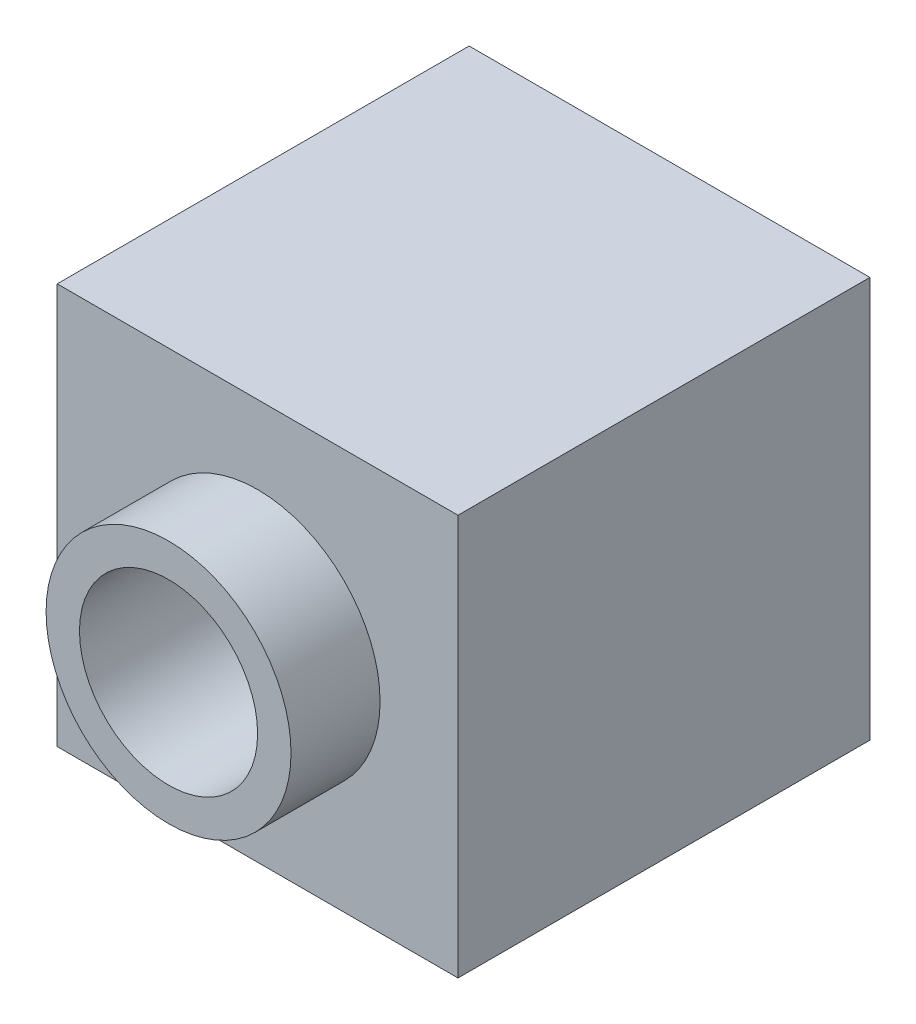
ISO-10303-21;
HEADER;
FILE_DESCRIPTION(('STEP AP214'),'2;1');
FILE_NAME('part.step','',(''),(''),'','','');
FILE_SCHEMA(('AUTOMOTIVE_DESIGN { 1 0 10303 214 1 1 1 1 }'));
ENDSEC;
DATA;
#1=APPLICATION_CONTEXT('core data for automotive mechanical design processes');
#2=APPLICATION_PROTOCOL_DEFINITION('international standard','automotive_design',2000,#1);
#3=PRODUCT_CONTEXT('',#1,'mechanical');
#4=PRODUCT('Part','Part','',(#3));
#5=PRODUCT_RELATED_PRODUCT_CATEGORY('part','',(#4));
#6=PRODUCT_DEFINITION_FORMATION('','',#4);
#7=PRODUCT_DEFINITION_CONTEXT('part definition',#1,'design');
#8=PRODUCT_DEFINITION('design','',#6,#7);
#9=PRODUCT_DEFINITION_SHAPE('','',#8);
#10=(LENGTH_UNIT() NAMED_UNIT(*) SI_UNIT(.MILLI.,.METRE.));
#11=(NAMED_UNIT(*) PLANE_ANGLE_UNIT() SI_UNIT($,.RADIAN.));
#12=(NAMED_UNIT(*) SI_UNIT($,.STERADIAN.) SOLID_ANGLE_UNIT());
#13=UNCERTAINTY_MEASURE_WITH_UNIT(LENGTH_MEASURE(1.E-05),#10,'distance_accuracy_value','');
#14=(GEOMETRIC_REPRESENTATION_CONTEXT(3) GLOBAL_UNCERTAINTY_ASSIGNED_CONTEXT((#13)) GLOBAL_UNIT_ASSIGNED_CONTEXT((#10,
#11,#12)) REPRESENTATION_CONTEXT('',''));
#15=CARTESIAN_POINT('',(0.,0.,0.));
#16=DIRECTION('',(0.,0.,1.));
#17=DIRECTION('',(1.,0.,0.));
#18=AXIS2_PLACEMENT_3D('',#15,#16,#17);
#19=CARTESIAN_POINT('',(9.,9.,-5.));
#20=DIRECTION('',(0.,-1.,0.));
#21=DIRECTION('',(0.,0.,-1.));
#22=AXIS2_PLACEMENT_3D('',#19,#20,#21);
#23=PLANE('',#22);
#24=DIRECTION('',(1.,0.,0.));
#25=VECTOR('',#24,1.);
#26=CARTESIAN_POINT('',(-9.,9.,0.));
#27=LINE('',#26,#25);
#28=CARTESIAN_POINT('',(-9.,9.,0.));
#29=VERTEX_POINT('',#28);
#30=CARTESIAN_POINT('',(9.,9.,0.));
#31=VERTEX_POINT('',#30);
#32=EDGE_CURVE('E60',#29,#31,#27,.T.);
#33=ORIENTED_EDGE('',*,*,#32,.F.);
#34=DIRECTION('',(0.,0.,1.));
#35=VECTOR('',#34,1.);
#36=CARTESIAN_POINT('',(-9.,9.,-77.));
#37=LINE('',#36,#35);
#38=CARTESIAN_POINT('',(-9.,9.,18.5));
#39=VERTEX_POINT('',#38);
#40=EDGE_CURVE('E53',#29,#39,#37,.T.);
#41=ORIENTED_EDGE('',*,*,#40,.T.);
#42=DIRECTION('',(1.,0.,0.));
#43=VECTOR('',#42,1.);
#44=CARTESIAN_POINT('',(0.,9.,18.5));
#45=LINE('',#44,#43);
#46=CARTESIAN_POINT('',(9.,9.,18.5));
#47=VERTEX_POINT('',#46);
#48=EDGE_CURVE('E74',#47,#39,#45,.F.);
#49=ORIENTED_EDGE('',*,*,#48,.F.);
#50=DIRECTION('',(0.,0.,1.));
#51=VECTOR('',#50,1.);
#52=CARTESIAN_POINT('',(9.,9.,-77.));
#53=LINE('',#52,#51);
#54=EDGE_CURVE('E70',#31,#47,#53,.T.);
#55=ORIENTED_EDGE('',*,*,#54,.F.);
#56=EDGE_LOOP('',(#33,#41,#49,#55));
#57=FACE_BOUND('',#56,.T.);
#58=ADVANCED_FACE('F14',(#57),#23,.F.);
#59=CARTESIAN_POINT('',(-9.,-9.,-5.));
#60=DIRECTION('',(0.,1.,0.));
#61=DIRECTION('',(0.,0.,1.));
#62=AXIS2_PLACEMENT_3D('',#59,#60,#61);
#63=PLANE('',#62);
#64=DIRECTION('',(-1.,0.,0.));
#65=VECTOR('',#64,1.);
#66=CARTESIAN_POINT('',(9.,-9.,0.));
#67=LINE('',#66,#65);
#68=CARTESIAN_POINT('',(9.,-9.,0.));
#69=VERTEX_POINT('',#68);
#70=CARTESIAN_POINT('',(-9.,-9.,0.));
#71=VERTEX_POINT('',#70);
#72=EDGE_CURVE('E31',#69,#71,#67,.T.);
#73=ORIENTED_EDGE('',*,*,#72,.F.);
#74=DIRECTION('',(0.,0.,1.));
#75=VECTOR('',#74,1.);
#76=CARTESIAN_POINT('',(9.,-9.,-77.));
#77=LINE('',#76,#75);
#78=CARTESIAN_POINT('',(9.,-9.,18.5));
#79=VERTEX_POINT('',#78);
#80=EDGE_CURVE('E71',#69,#79,#77,.T.);
#81=ORIENTED_EDGE('',*,*,#80,.T.);
#82=DIRECTION('',(-1.,0.,0.));
#83=VECTOR('',#82,1.);
#84=CARTESIAN_POINT('',(0.,-9.,18.5));
#85=LINE('',#84,#83);
#86=CARTESIAN_POINT('',(-9.,-9.,18.5));
#87=VERTEX_POINT('',#86);
#88=EDGE_CURVE('E23',#87,#79,#85,.F.);
#89=ORIENTED_EDGE('',*,*,#88,.F.);
#90=DIRECTION('',(0.,0.,1.));
#91=VECTOR('',#90,1.);
#92=CARTESIAN_POINT('',(-9.,-9.,-77.));
#93=LINE('',#92,#91);
#94=EDGE_CURVE('E18',#71,#87,#93,.T.);
#95=ORIENTED_EDGE('',*,*,#94,.F.);
#96=EDGE_LOOP('',(#73,#81,#89,#95));
#97=FACE_BOUND('',#96,.T.);
#98=ADVANCED_FACE('F107',(#97),#63,.F.);
#99=CARTESIAN_POINT('',(9.,-9.,-77.));
#100=DIRECTION('',(1.,0.,0.));
#101=DIRECTION('',(0.,0.,-1.));
#102=AXIS2_PLACEMENT_3D('',#99,#100,#101);
#103=PLANE('',#102);
#104=ORIENTED_EDGE('',*,*,#80,.F.);
#105=DIRECTION('',(0.,-1.,0.));
#106=VECTOR('',#105,1.);
#107=CARTESIAN_POINT('',(9.,9.,0.));
#108=LINE('',#107,#106);
#109=EDGE_CURVE('E63',#31,#69,#108,.T.);
#110=ORIENTED_EDGE('',*,*,#109,.F.);
#111=ORIENTED_EDGE('',*,*,#54,.T.);
#112=DIRECTION('',(0.,-1.,0.));
#113=VECTOR('',#112,1.);
#114=CARTESIAN_POINT('',(9.,0.,18.5));
#115=LINE('',#114,#113);
#116=EDGE_CURVE('E9',#79,#47,#115,.F.);
#117=ORIENTED_EDGE('',*,*,#116,.F.);
#118=EDGE_LOOP('',(#104,#110,#111,#117));
#119=FACE_BOUND('',#118,.T.);
#120=ADVANCED_FACE('F68',(#119),#103,.T.);
#121=CARTESIAN_POINT('',(-9.,9.,-77.));
#122=DIRECTION('',(-1.,0.,0.));
#123=DIRECTION('',(0.,0.,1.));
#124=AXIS2_PLACEMENT_3D('',#121,#122,#123);
#125=PLANE('',#124);
#126=ORIENTED_EDGE('',*,*,#40,.F.);
#127=DIRECTION('',(0.,1.,0.));
#128=VECTOR('',#127,1.);
#129=CARTESIAN_POINT('',(-9.,-9.,0.));
#130=LINE('',#129,#128);
#131=EDGE_CURVE('E56',#71,#29,#130,.T.);
#132=ORIENTED_EDGE('',*,*,#131,.F.);
#133=ORIENTED_EDGE('',*,*,#94,.T.);
#134=DIRECTION('',(0.,1.,0.));
#135=VECTOR('',#134,1.);
#136=CARTESIAN_POINT('',(-9.,0.,18.5));
#137=LINE('',#136,#135);
#138=EDGE_CURVE('E80',#39,#87,#137,.F.);
#139=ORIENTED_EDGE('',*,*,#138,.F.);
#140=EDGE_LOOP('',(#126,#132,#133,#139));
#141=FACE_BOUND('',#140,.T.);
#142=ADVANCED_FACE('F16',(#141),#125,.T.);
#143=CARTESIAN_POINT('',(-4.048,-4.048,12.5));
#144=DIRECTION('',(0.,0.,1.));
#145=DIRECTION('',(1.,0.,0.));
#146=AXIS2_PLACEMENT_3D('',#143,#144,#145);
#147=PLANE('',#146);
#148=CARTESIAN_POINT('',(0.,0.,12.5));
#149=DIRECTION('',(0.,0.,1.));
#150=DIRECTION('',(1.,0.,0.));
#151=AXIS2_PLACEMENT_3D('',#148,#149,#150);
#152=CIRCLE('',#151,4.);
#153=CARTESIAN_POINT('',(4.,0.,12.5));
#154=VERTEX_POINT('',#153);
#155=EDGE_CURVE('E89',#154,#154,#152,.F.);
#156=ORIENTED_EDGE('',*,*,#155,.F.);
#157=EDGE_LOOP('',(#156));
#158=FACE_BOUND('',#157,.T.);
#159=ADVANCED_FACE('F121',(#158),#147,.T.);
#160=CARTESIAN_POINT('',(0.,0.,12.5));
#161=DIRECTION('',(0.,0.,1.));
#162=DIRECTION('',(1.,0.,0.));
#163=AXIS2_PLACEMENT_3D('',#160,#161,#162);
#164=CYLINDRICAL_SURFACE('',#163,4.);
#165=CARTESIAN_POINT('',(0.,0.,22.5));
#166=DIRECTION('',(0.,0.,1.));
#167=DIRECTION('',(1.,0.,0.));
#168=AXIS2_PLACEMENT_3D('',#165,#166,#167);
#169=CIRCLE('',#168,4.);
#170=CARTESIAN_POINT('',(4.,0.,22.5));
#171=VERTEX_POINT('',#170);
#172=EDGE_CURVE('E79',#171,#171,#169,.T.);
#173=ORIENTED_EDGE('',*,*,#172,.T.);
#174=EDGE_LOOP('',(#173));
#175=FACE_BOUND('',#174,.T.);
#176=ORIENTED_EDGE('',*,*,#155,.T.);
#177=EDGE_LOOP('',(#176));
#178=FACE_BOUND('',#177,.T.);
#179=ADVANCED_FACE('F124',(#175,#178),#164,.F.);
#180=CARTESIAN_POINT('',(-5.566,-5.566,22.5));
#181=DIRECTION('',(0.,0.,1.));
#182=DIRECTION('',(1.,0.,0.));
#183=AXIS2_PLACEMENT_3D('',#180,#181,#182);
#184=PLANE('',#183);
#185=ORIENTED_EDGE('',*,*,#172,.F.);
#186=EDGE_LOOP('',(#185));
#187=FACE_BOUND('',#186,.T.);
#188=CARTESIAN_POINT('',(0.,0.,22.5));
#189=DIRECTION('',(0.,0.,-1.));
#190=DIRECTION('',(-1.,0.,0.));
#191=AXIS2_PLACEMENT_3D('',#188,#189,#190);
#192=CIRCLE('',#191,5.5);
#193=CARTESIAN_POINT('',(-5.5,0.,22.5));
#194=VERTEX_POINT('',#193);
#195=EDGE_CURVE('E92',#194,#194,#192,.F.);
#196=ORIENTED_EDGE('',*,*,#195,.T.);
#197=EDGE_LOOP('',(#196));
#198=FACE_BOUND('',#197,.T.);
#199=ADVANCED_FACE('F120',(#187,#198),#184,.T.);
#200=CARTESIAN_POINT('',(0.,0.,22.5));
#201=DIRECTION('',(0.,0.,-1.));
#202=DIRECTION('',(-1.,0.,0.));
#203=AXIS2_PLACEMENT_3D('',#200,#201,#202);
#204=CYLINDRICAL_SURFACE('',#203,5.5);
#205=CARTESIAN_POINT('',(0.,0.,18.5));
#206=DIRECTION('',(0.,0.,-1.));
#207=DIRECTION('',(-1.,0.,0.));
#208=AXIS2_PLACEMENT_3D('',#205,#206,#207);
#209=CIRCLE('',#208,5.5);
#210=CARTESIAN_POINT('',(-5.5,0.,18.5));
#211=VERTEX_POINT('',#210);
#212=EDGE_CURVE('E83',#211,#211,#209,.F.);
#213=ORIENTED_EDGE('',*,*,#212,.T.);
#214=EDGE_LOOP('',(#213));
#215=FACE_BOUND('',#214,.T.);
#216=ORIENTED_EDGE('',*,*,#195,.F.);
#217=EDGE_LOOP('',(#216));
#218=FACE_BOUND('',#217,.T.);
#219=ADVANCED_FACE('F99',(#215,#218),#204,.T.);
#220=CARTESIAN_POINT('',(9.,-9.,18.5));
#221=DIRECTION('',(0.,0.,-1.));
#222=DIRECTION('',(-1.,0.,0.));
#223=AXIS2_PLACEMENT_3D('',#220,#221,#222);
#224=PLANE('',#223);
#225=ORIENTED_EDGE('',*,*,#212,.F.);
#226=EDGE_LOOP('',(#225));
#227=FACE_BOUND('',#226,.T.);
#228=ORIENTED_EDGE('',*,*,#48,.T.);
#229=ORIENTED_EDGE('',*,*,#138,.T.);
#230=ORIENTED_EDGE('',*,*,#88,.T.);
#231=ORIENTED_EDGE('',*,*,#116,.T.);
#232=EDGE_LOOP('',(#228,#229,#230,#231));
#233=FACE_BOUND('',#232,.T.);
#234=ADVANCED_FACE('F102',(#227,#233),#224,.F.);
#235=CARTESIAN_POINT('',(0.,0.,0.));
#236=DIRECTION('',(0.,0.,-1.));
#237=DIRECTION('',(-1.,0.,0.));
#238=AXIS2_PLACEMENT_3D('',#235,#236,#237);
#239=PLANE('',#238);
#240=ORIENTED_EDGE('',*,*,#32,.T.);
#241=ORIENTED_EDGE('',*,*,#109,.T.);
#242=ORIENTED_EDGE('',*,*,#72,.T.);
#243=ORIENTED_EDGE('',*,*,#131,.T.);
#244=EDGE_LOOP('',(#240,#241,#242,#243));
#245=FACE_BOUND('',#244,.T.);
#246=ADVANCED_FACE('F62',(#245),#239,.T.);
#247=CLOSED_SHELL('',(#58,#98,#120,#142,#159,#179,#199,#219,#234,#246));
#248=MANIFOLD_SOLID_BREP('B1',#247);
#249=ADVANCED_BREP_SHAPE_REPRESENTATION('',(#18,#248),#14);
#250=SHAPE_DEFINITION_REPRESENTATION(#9,#249);
ENDSEC;
END-ISO-10303-21;
